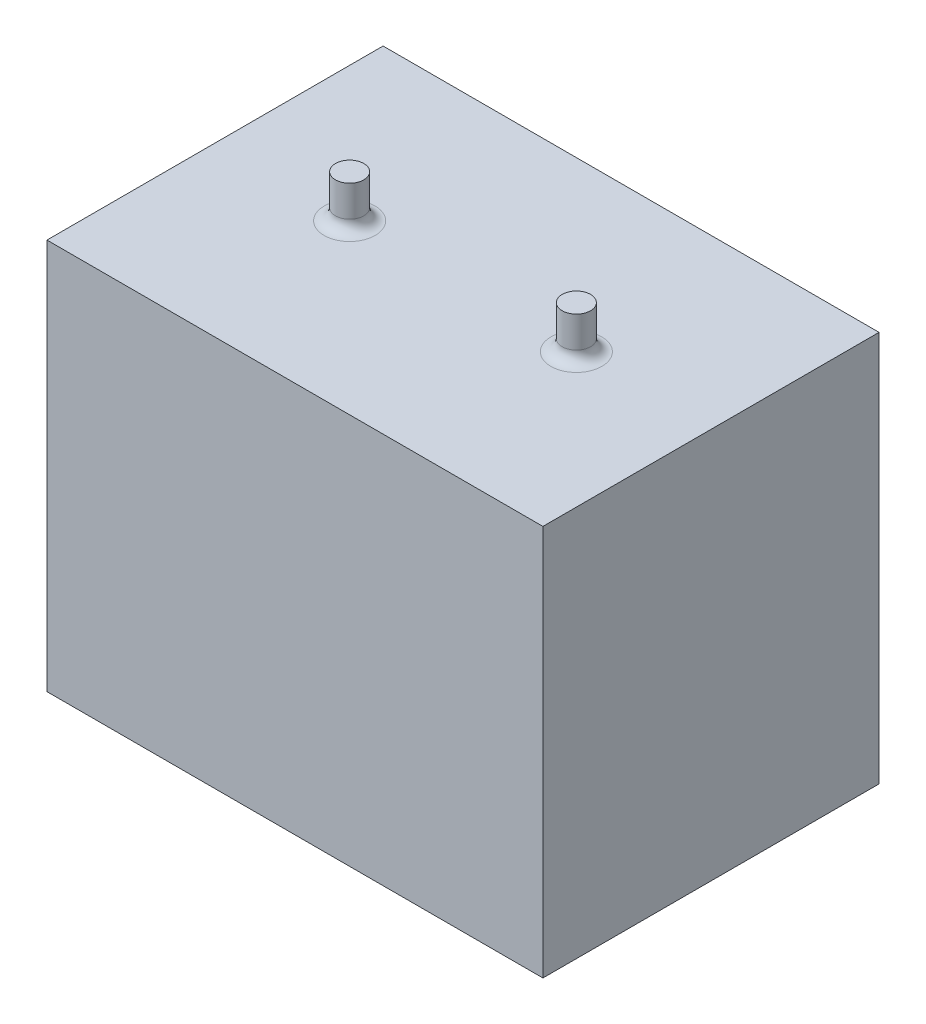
ISO-10303-21;
HEADER;
FILE_DESCRIPTION(('STEP AP214'),'2;1');
FILE_NAME('part.step','',(''),(''),'','','');
FILE_SCHEMA(('AUTOMOTIVE_DESIGN { 1 0 10303 214 1 1 1 1 }'));
ENDSEC;
DATA;
#1=APPLICATION_CONTEXT('core data for automotive mechanical design processes');
#2=APPLICATION_PROTOCOL_DEFINITION('international standard','automotive_design',2000,#1);
#3=PRODUCT_CONTEXT('',#1,'mechanical');
#4=PRODUCT('Part','Part','',(#3));
#5=PRODUCT_RELATED_PRODUCT_CATEGORY('part','',(#4));
#6=PRODUCT_DEFINITION_FORMATION('','',#4);
#7=PRODUCT_DEFINITION_CONTEXT('part definition',#1,'design');
#8=PRODUCT_DEFINITION('design','',#6,#7);
#9=PRODUCT_DEFINITION_SHAPE('','',#8);
#10=(LENGTH_UNIT() NAMED_UNIT(*) SI_UNIT(.MILLI.,.METRE.));
#11=(NAMED_UNIT(*) PLANE_ANGLE_UNIT() SI_UNIT($,.RADIAN.));
#12=(NAMED_UNIT(*) SI_UNIT($,.STERADIAN.) SOLID_ANGLE_UNIT());
#13=UNCERTAINTY_MEASURE_WITH_UNIT(LENGTH_MEASURE(1.E-05),#10,'distance_accuracy_value','');
#14=(GEOMETRIC_REPRESENTATION_CONTEXT(3) GLOBAL_UNCERTAINTY_ASSIGNED_CONTEXT((#13)) GLOBAL_UNIT_ASSIGNED_CONTEXT((#10,
#11,#12)) REPRESENTATION_CONTEXT('',''));
#15=CARTESIAN_POINT('',(0.,0.,0.));
#16=DIRECTION('',(0.,0.,1.));
#17=DIRECTION('',(1.,0.,0.));
#18=AXIS2_PLACEMENT_3D('',#15,#16,#17);
#19=CARTESIAN_POINT('',(0.,0.,150.622));
#20=DIRECTION('',(1.,0.,0.));
#21=DIRECTION('',(0.,1.,0.));
#22=AXIS2_PLACEMENT_3D('',#19,#20,#21);
#23=PLANE('',#22);
#24=DIRECTION('',(0.,-1.,0.));
#25=VECTOR('',#24,1.);
#26=CARTESIAN_POINT('',(0.,0.,0.));
#27=LINE('',#26,#25);
#28=CARTESIAN_POINT('',(0.,175.26,0.));
#29=VERTEX_POINT('',#28);
#30=CARTESIAN_POINT('',(0.,0.,0.));
#31=VERTEX_POINT('',#30);
#32=EDGE_CURVE('E100',#29,#31,#27,.T.);
#33=ORIENTED_EDGE('',*,*,#32,.T.);
#34=DIRECTION('',(0.,0.,-1.));
#35=VECTOR('',#34,1.);
#36=CARTESIAN_POINT('',(0.,0.,150.622));
#37=LINE('',#36,#35);
#38=CARTESIAN_POINT('',(0.,0.,150.622));
#39=VERTEX_POINT('',#38);
#40=EDGE_CURVE('E91',#39,#31,#37,.T.);
#41=ORIENTED_EDGE('',*,*,#40,.F.);
#42=DIRECTION('',(0.,-1.,0.));
#43=VECTOR('',#42,1.);
#44=CARTESIAN_POINT('',(0.,0.,150.622));
#45=LINE('',#44,#43);
#46=CARTESIAN_POINT('',(0.,175.26,150.622));
#47=VERTEX_POINT('',#46);
#48=EDGE_CURVE('E85',#47,#39,#45,.T.);
#49=ORIENTED_EDGE('',*,*,#48,.F.);
#50=DIRECTION('',(0.,0.,-1.));
#51=VECTOR('',#50,1.);
#52=CARTESIAN_POINT('',(0.,175.26,150.622));
#53=LINE('',#52,#51);
#54=EDGE_CURVE('E96',#47,#29,#53,.T.);
#55=ORIENTED_EDGE('',*,*,#54,.T.);
#56=EDGE_LOOP('',(#33,#41,#49,#55));
#57=FACE_BOUND('',#56,.T.);
#58=ADVANCED_FACE('F32',(#57),#23,.F.);
#59=CARTESIAN_POINT('',(0.,0.,150.622));
#60=DIRECTION('',(0.,1.,0.));
#61=DIRECTION('',(0.,0.,1.));
#62=AXIS2_PLACEMENT_3D('',#59,#60,#61);
#63=PLANE('',#62);
#64=DIRECTION('',(1.,0.,0.));
#65=VECTOR('',#64,1.);
#66=CARTESIAN_POINT('',(0.,0.,0.));
#67=LINE('',#66,#65);
#68=CARTESIAN_POINT('',(222.25,0.,0.));
#69=VERTEX_POINT('',#68);
#70=EDGE_CURVE('E90',#31,#69,#67,.T.);
#71=ORIENTED_EDGE('',*,*,#70,.T.);
#72=DIRECTION('',(0.,0.,-1.));
#73=VECTOR('',#72,1.);
#74=CARTESIAN_POINT('',(222.25,0.,150.622));
#75=LINE('',#74,#73);
#76=CARTESIAN_POINT('',(222.25,0.,150.622));
#77=VERTEX_POINT('',#76);
#78=EDGE_CURVE('E88',#77,#69,#75,.T.);
#79=ORIENTED_EDGE('',*,*,#78,.F.);
#80=DIRECTION('',(1.,0.,0.));
#81=VECTOR('',#80,1.);
#82=CARTESIAN_POINT('',(0.,0.,150.622));
#83=LINE('',#82,#81);
#84=EDGE_CURVE('E80',#39,#77,#83,.T.);
#85=ORIENTED_EDGE('',*,*,#84,.F.);
#86=ORIENTED_EDGE('',*,*,#40,.T.);
#87=EDGE_LOOP('',(#71,#79,#85,#86));
#88=FACE_BOUND('',#87,.T.);
#89=ADVANCED_FACE('F89',(#88),#63,.F.);
#90=CARTESIAN_POINT('',(222.25,0.,150.622));
#91=DIRECTION('',(-1.,0.,0.));
#92=DIRECTION('',(0.,-1.,0.));
#93=AXIS2_PLACEMENT_3D('',#90,#91,#92);
#94=PLANE('',#93);
#95=DIRECTION('',(0.,1.,0.));
#96=VECTOR('',#95,1.);
#97=CARTESIAN_POINT('',(222.25,0.,0.));
#98=LINE('',#97,#96);
#99=CARTESIAN_POINT('',(222.25,175.26,0.));
#100=VERTEX_POINT('',#99);
#101=EDGE_CURVE('E66',#69,#100,#98,.T.);
#102=ORIENTED_EDGE('',*,*,#101,.T.);
#103=DIRECTION('',(0.,0.,-1.));
#104=VECTOR('',#103,1.);
#105=CARTESIAN_POINT('',(222.25,175.26,150.622));
#106=LINE('',#105,#104);
#107=CARTESIAN_POINT('',(222.25,175.26,150.622));
#108=VERTEX_POINT('',#107);
#109=EDGE_CURVE('E92',#108,#100,#106,.T.);
#110=ORIENTED_EDGE('',*,*,#109,.F.);
#111=DIRECTION('',(0.,1.,0.));
#112=VECTOR('',#111,1.);
#113=CARTESIAN_POINT('',(222.25,0.,150.622));
#114=LINE('',#113,#112);
#115=EDGE_CURVE('E83',#77,#108,#114,.T.);
#116=ORIENTED_EDGE('',*,*,#115,.F.);
#117=ORIENTED_EDGE('',*,*,#78,.T.);
#118=EDGE_LOOP('',(#102,#110,#116,#117));
#119=FACE_BOUND('',#118,.T.);
#120=ADVANCED_FACE('F94',(#119),#94,.F.);
#121=CARTESIAN_POINT('',(0.,175.26,150.622));
#122=DIRECTION('',(0.,-1.,0.));
#123=DIRECTION('',(0.,0.,-1.));
#124=AXIS2_PLACEMENT_3D('',#121,#122,#123);
#125=PLANE('',#124);
#126=CARTESIAN_POINT('',(161.925,175.26,75.311));
#127=DIRECTION('',(0.,-1.,0.));
#128=DIRECTION('',(0.,0.,-1.));
#129=AXIS2_PLACEMENT_3D('',#126,#127,#128);
#130=CIRCLE('',#129,11.43);
#131=CARTESIAN_POINT('',(161.925,175.26,63.881));
#132=VERTEX_POINT('',#131);
#133=EDGE_CURVE('E11',#132,#132,#130,.T.);
#134=ORIENTED_EDGE('',*,*,#133,.T.);
#135=EDGE_LOOP('',(#134));
#136=FACE_BOUND('',#135,.T.);
#137=CARTESIAN_POINT('',(60.325,175.26,75.311));
#138=DIRECTION('',(0.,-1.,0.));
#139=DIRECTION('',(0.,0.,-1.));
#140=AXIS2_PLACEMENT_3D('',#137,#138,#139);
#141=CIRCLE('',#140,11.43);
#142=CARTESIAN_POINT('',(60.325,175.26,63.881));
#143=VERTEX_POINT('',#142);
#144=EDGE_CURVE('E113',#143,#143,#141,.T.);
#145=ORIENTED_EDGE('',*,*,#144,.T.);
#146=EDGE_LOOP('',(#145));
#147=FACE_BOUND('',#146,.T.);
#148=DIRECTION('',(-1.,0.,0.));
#149=VECTOR('',#148,1.);
#150=CARTESIAN_POINT('',(0.,175.26,0.));
#151=LINE('',#150,#149);
#152=EDGE_CURVE('E72',#100,#29,#151,.T.);
#153=ORIENTED_EDGE('',*,*,#152,.T.);
#154=ORIENTED_EDGE('',*,*,#54,.F.);
#155=DIRECTION('',(-1.,0.,0.));
#156=VECTOR('',#155,1.);
#157=CARTESIAN_POINT('',(0.,175.26,150.622));
#158=LINE('',#157,#156);
#159=EDGE_CURVE('E49',#108,#47,#158,.T.);
#160=ORIENTED_EDGE('',*,*,#159,.F.);
#161=ORIENTED_EDGE('',*,*,#109,.T.);
#162=EDGE_LOOP('',(#153,#154,#160,#161));
#163=FACE_BOUND('',#162,.T.);
#164=ADVANCED_FACE('F140',(#136,#147,#163),#125,.F.);
#165=CARTESIAN_POINT('',(0.,0.,150.622));
#166=DIRECTION('',(0.,0.,-1.));
#167=DIRECTION('',(-1.,0.,0.));
#168=AXIS2_PLACEMENT_3D('',#165,#166,#167);
#169=PLANE('',#168);
#170=ORIENTED_EDGE('',*,*,#48,.T.);
#171=ORIENTED_EDGE('',*,*,#84,.T.);
#172=ORIENTED_EDGE('',*,*,#115,.T.);
#173=ORIENTED_EDGE('',*,*,#159,.T.);
#174=EDGE_LOOP('',(#170,#171,#172,#173));
#175=FACE_BOUND('',#174,.T.);
#176=ADVANCED_FACE('F81',(#175),#169,.F.);
#177=CARTESIAN_POINT('',(0.,0.,0.));
#178=DIRECTION('',(0.,0.,-1.));
#179=DIRECTION('',(-1.,0.,0.));
#180=AXIS2_PLACEMENT_3D('',#177,#178,#179);
#181=PLANE('',#180);
#182=ORIENTED_EDGE('',*,*,#32,.F.);
#183=ORIENTED_EDGE('',*,*,#152,.F.);
#184=ORIENTED_EDGE('',*,*,#101,.F.);
#185=ORIENTED_EDGE('',*,*,#70,.F.);
#186=EDGE_LOOP('',(#182,#183,#184,#185));
#187=FACE_BOUND('',#186,.T.);
#188=ADVANCED_FACE('F144',(#187),#181,.T.);
#189=CARTESIAN_POINT('',(60.325,194.31,75.311));
#190=DIRECTION('',(0.,-1.,0.));
#191=DIRECTION('',(0.,0.,-1.));
#192=AXIS2_PLACEMENT_3D('',#189,#190,#191);
#193=CYLINDRICAL_SURFACE('',#192,6.35);
#194=CARTESIAN_POINT('',(60.325,180.34,75.311));
#195=DIRECTION('',(0.,-1.,0.));
#196=DIRECTION('',(0.,0.,-1.));
#197=AXIS2_PLACEMENT_3D('',#194,#195,#196);
#198=CIRCLE('',#197,6.35);
#199=CARTESIAN_POINT('',(60.325,180.34,68.961));
#200=VERTEX_POINT('',#199);
#201=EDGE_CURVE('E110',#200,#200,#198,.F.);
#202=CARTESIAN_POINT('',(60.325,194.31,75.311));
#203=DIRECTION('',(0.,1.,0.));
#204=DIRECTION('',(0.,0.,1.));
#205=AXIS2_PLACEMENT_3D('',#202,#203,#204);
#206=CIRCLE('',#205,6.35);
#207=CARTESIAN_POINT('',(60.325,194.31,68.961));
#208=VERTEX_POINT('',#207);
#209=EDGE_CURVE('E103',#208,#208,#206,.T.);
#210=CARTESIAN_POINT('',(60.325,180.34,68.961));
#211=CARTESIAN_POINT('',(60.325,180.485520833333,68.961));
#212=CARTESIAN_POINT('',(60.325,180.631041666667,68.961));
#213=CARTESIAN_POINT('',(60.325,180.922083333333,68.961));
#214=CARTESIAN_POINT('',(60.325,181.067604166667,68.961));
#215=CARTESIAN_POINT('',(60.325,181.358645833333,68.961));
#216=CARTESIAN_POINT('',(60.325,181.504166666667,68.961));
#217=CARTESIAN_POINT('',(60.325,181.795208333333,68.961));
#218=CARTESIAN_POINT('',(60.325,181.940729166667,68.961));
#219=CARTESIAN_POINT('',(60.325,182.231770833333,68.961));
#220=CARTESIAN_POINT('',(60.325,182.377291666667,68.961));
#221=CARTESIAN_POINT('',(60.325,182.668333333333,68.961));
#222=CARTESIAN_POINT('',(60.325,182.813854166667,68.961));
#223=CARTESIAN_POINT('',(60.325,183.104895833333,68.961));
#224=CARTESIAN_POINT('',(60.325,183.250416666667,68.961));
#225=CARTESIAN_POINT('',(60.325,183.541458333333,68.961));
#226=CARTESIAN_POINT('',(60.325,183.686979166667,68.961));
#227=CARTESIAN_POINT('',(60.325,183.978020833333,68.961));
#228=CARTESIAN_POINT('',(60.325,184.123541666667,68.961));
#229=CARTESIAN_POINT('',(60.325,184.414583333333,68.961));
#230=CARTESIAN_POINT('',(60.325,184.560104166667,68.961));
#231=CARTESIAN_POINT('',(60.325,184.851145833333,68.961));
#232=CARTESIAN_POINT('',(60.325,184.996666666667,68.961));
#233=CARTESIAN_POINT('',(60.325,185.287708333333,68.961));
#234=CARTESIAN_POINT('',(60.325,185.433229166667,68.961));
#235=CARTESIAN_POINT('',(60.325,185.724270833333,68.961));
#236=CARTESIAN_POINT('',(60.325,185.869791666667,68.961));
#237=CARTESIAN_POINT('',(60.325,186.160833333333,68.961));
#238=CARTESIAN_POINT('',(60.325,186.306354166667,68.961));
#239=CARTESIAN_POINT('',(60.325,186.597395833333,68.961));
#240=CARTESIAN_POINT('',(60.325,186.742916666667,68.961));
#241=CARTESIAN_POINT('',(60.325,187.033958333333,68.961));
#242=CARTESIAN_POINT('',(60.325,187.179479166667,68.961));
#243=CARTESIAN_POINT('',(60.325,187.470520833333,68.961));
#244=CARTESIAN_POINT('',(60.325,187.616041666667,68.961));
#245=CARTESIAN_POINT('',(60.325,187.907083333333,68.961));
#246=CARTESIAN_POINT('',(60.325,188.052604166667,68.961));
#247=CARTESIAN_POINT('',(60.325,188.343645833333,68.961));
#248=CARTESIAN_POINT('',(60.325,188.489166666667,68.961));
#249=CARTESIAN_POINT('',(60.325,188.780208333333,68.961));
#250=CARTESIAN_POINT('',(60.325,188.925729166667,68.961));
#251=CARTESIAN_POINT('',(60.325,189.216770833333,68.961));
#252=CARTESIAN_POINT('',(60.325,189.362291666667,68.961));
#253=CARTESIAN_POINT('',(60.325,189.653333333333,68.961));
#254=CARTESIAN_POINT('',(60.325,189.798854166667,68.961));
#255=CARTESIAN_POINT('',(60.325,190.089895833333,68.961));
#256=CARTESIAN_POINT('',(60.325,190.235416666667,68.961));
#257=CARTESIAN_POINT('',(60.325,190.526458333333,68.961));
#258=CARTESIAN_POINT('',(60.325,190.671979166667,68.961));
#259=CARTESIAN_POINT('',(60.325,190.963020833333,68.961));
#260=CARTESIAN_POINT('',(60.325,191.108541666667,68.961));
#261=CARTESIAN_POINT('',(60.325,191.399583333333,68.961));
#262=CARTESIAN_POINT('',(60.325,191.545104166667,68.961));
#263=CARTESIAN_POINT('',(60.325,191.836145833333,68.961));
#264=CARTESIAN_POINT('',(60.325,191.981666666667,68.961));
#265=CARTESIAN_POINT('',(60.325,192.272708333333,68.961));
#266=CARTESIAN_POINT('',(60.325,192.418229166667,68.961));
#267=CARTESIAN_POINT('',(60.325,192.709270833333,68.961));
#268=CARTESIAN_POINT('',(60.325,192.854791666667,68.961));
#269=CARTESIAN_POINT('',(60.325,193.145833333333,68.961));
#270=CARTESIAN_POINT('',(60.325,193.291354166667,68.961));
#271=CARTESIAN_POINT('',(60.325,193.582395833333,68.961));
#272=CARTESIAN_POINT('',(60.325,193.727916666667,68.961));
#273=CARTESIAN_POINT('',(60.325,194.018958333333,68.961));
#274=CARTESIAN_POINT('',(60.325,194.164479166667,68.961));
#275=CARTESIAN_POINT('',(60.325,194.31,68.961));
#276=B_SPLINE_CURVE_WITH_KNOTS('',3,(#210,#211,#212,#213,#214,#215,#216,#217,#218,#219,#220,
#221,#222,#223,#224,#225,#226,#227,#228,#229,#230,#231,#232,#233,#234,#235,#236,#237,#238,#239,
#240,#241,#242,#243,#244,#245,#246,#247,#248,#249,#250,#251,#252,#253,#254,#255,#256,#257,#258,
#259,#260,#261,#262,#263,#264,#265,#266,#267,#268,#269,#270,#271,#272,#273,#274,#275),
.UNSPECIFIED.,.F.,.F.,(4,2,2,2,2,2,2,2,2,2,2,2,2,2,2,2,2,2,2,2,2,2,2,2,2,2,2,2,2,2,2,2,4),(0.,
0.436562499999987,0.873124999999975,1.30968749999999,1.74624999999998,2.18281249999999,
2.61937499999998,3.05593749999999,3.49249999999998,3.9290625,4.36562499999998,4.80218749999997,
5.23874999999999,5.67531249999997,6.11187499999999,6.54843749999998,6.98499999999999,
7.42156249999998,7.85812499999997,8.29468749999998,8.73124999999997,9.16781249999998,
9.60437499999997,10.0409375,10.4775,10.9140625,11.350625,11.7871875,12.22375,12.6603125,
13.096875,13.5334375,13.97),.UNSPECIFIED.);
#277=EDGE_CURVE('BSEAM147',#200,#208,#276,.T.);
#278=ORIENTED_EDGE('',*,*,#201,.T.);
#279=ORIENTED_EDGE('',*,*,#209,.F.);
#280=ORIENTED_EDGE('',*,*,#277,.T.);
#281=ORIENTED_EDGE('',*,*,#277,.F.);
#282=EDGE_LOOP('',(#278,#280,#279,#281));
#283=FACE_BOUND('',#282,.T.);
#284=ADVANCED_FACE('F147',(#283),#193,.T.);
#285=CARTESIAN_POINT('',(60.325,194.31,75.311));
#286=DIRECTION('',(0.,1.,0.));
#287=DIRECTION('',(0.,0.,1.));
#288=AXIS2_PLACEMENT_3D('',#285,#286,#287);
#289=PLANE('',#288);
#290=ORIENTED_EDGE('',*,*,#209,.T.);
#291=EDGE_LOOP('',(#290));
#292=FACE_BOUND('',#291,.T.);
#293=ADVANCED_FACE('F153',(#292),#289,.T.);
#294=CARTESIAN_POINT('',(161.925,194.31,75.311));
#295=DIRECTION('',(0.,-1.,0.));
#296=DIRECTION('',(0.,0.,-1.));
#297=AXIS2_PLACEMENT_3D('',#294,#295,#296);
#298=CYLINDRICAL_SURFACE('',#297,6.34999999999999);
#299=CARTESIAN_POINT('',(161.925,180.34,75.311));
#300=DIRECTION('',(0.,-1.,0.));
#301=DIRECTION('',(0.,0.,-1.));
#302=AXIS2_PLACEMENT_3D('',#299,#300,#301);
#303=CIRCLE('',#302,6.34999999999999);
#304=CARTESIAN_POINT('',(161.925,180.34,68.961));
#305=VERTEX_POINT('',#304);
#306=EDGE_CURVE('E41',#305,#305,#303,.F.);
#307=CARTESIAN_POINT('',(161.925,194.31,75.311));
#308=DIRECTION('',(0.,1.,0.));
#309=DIRECTION('',(0.,0.,1.));
#310=AXIS2_PLACEMENT_3D('',#307,#308,#309);
#311=CIRCLE('',#310,6.34999999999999);
#312=CARTESIAN_POINT('',(161.925,194.31,68.961));
#313=VERTEX_POINT('',#312);
#314=EDGE_CURVE('E166',#313,#313,#311,.T.);
#315=CARTESIAN_POINT('',(161.925,180.34,68.961));
#316=CARTESIAN_POINT('',(161.925,180.485520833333,68.961));
#317=CARTESIAN_POINT('',(161.925,180.631041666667,68.961));
#318=CARTESIAN_POINT('',(161.925,180.922083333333,68.961));
#319=CARTESIAN_POINT('',(161.925,181.067604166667,68.961));
#320=CARTESIAN_POINT('',(161.925,181.358645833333,68.961));
#321=CARTESIAN_POINT('',(161.925,181.504166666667,68.961));
#322=CARTESIAN_POINT('',(161.925,181.795208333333,68.961));
#323=CARTESIAN_POINT('',(161.925,181.940729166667,68.961));
#324=CARTESIAN_POINT('',(161.925,182.231770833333,68.961));
#325=CARTESIAN_POINT('',(161.925,182.377291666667,68.961));
#326=CARTESIAN_POINT('',(161.925,182.668333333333,68.961));
#327=CARTESIAN_POINT('',(161.925,182.813854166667,68.961));
#328=CARTESIAN_POINT('',(161.925,183.104895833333,68.961));
#329=CARTESIAN_POINT('',(161.925,183.250416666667,68.961));
#330=CARTESIAN_POINT('',(161.925,183.541458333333,68.961));
#331=CARTESIAN_POINT('',(161.925,183.686979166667,68.961));
#332=CARTESIAN_POINT('',(161.925,183.978020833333,68.961));
#333=CARTESIAN_POINT('',(161.925,184.123541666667,68.961));
#334=CARTESIAN_POINT('',(161.925,184.414583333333,68.961));
#335=CARTESIAN_POINT('',(161.925,184.560104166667,68.961));
#336=CARTESIAN_POINT('',(161.925,184.851145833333,68.961));
#337=CARTESIAN_POINT('',(161.925,184.996666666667,68.961));
#338=CARTESIAN_POINT('',(161.925,185.287708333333,68.961));
#339=CARTESIAN_POINT('',(161.925,185.433229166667,68.961));
#340=CARTESIAN_POINT('',(161.925,185.724270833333,68.961));
#341=CARTESIAN_POINT('',(161.925,185.869791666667,68.961));
#342=CARTESIAN_POINT('',(161.925,186.160833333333,68.961));
#343=CARTESIAN_POINT('',(161.925,186.306354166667,68.961));
#344=CARTESIAN_POINT('',(161.925,186.597395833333,68.961));
#345=CARTESIAN_POINT('',(161.925,186.742916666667,68.961));
#346=CARTESIAN_POINT('',(161.925,187.033958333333,68.961));
#347=CARTESIAN_POINT('',(161.925,187.179479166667,68.961));
#348=CARTESIAN_POINT('',(161.925,187.470520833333,68.961));
#349=CARTESIAN_POINT('',(161.925,187.616041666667,68.961));
#350=CARTESIAN_POINT('',(161.925,187.907083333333,68.961));
#351=CARTESIAN_POINT('',(161.925,188.052604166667,68.961));
#352=CARTESIAN_POINT('',(161.925,188.343645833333,68.961));
#353=CARTESIAN_POINT('',(161.925,188.489166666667,68.961));
#354=CARTESIAN_POINT('',(161.925,188.780208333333,68.961));
#355=CARTESIAN_POINT('',(161.925,188.925729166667,68.961));
#356=CARTESIAN_POINT('',(161.925,189.216770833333,68.961));
#357=CARTESIAN_POINT('',(161.925,189.362291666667,68.961));
#358=CARTESIAN_POINT('',(161.925,189.653333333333,68.961));
#359=CARTESIAN_POINT('',(161.925,189.798854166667,68.961));
#360=CARTESIAN_POINT('',(161.925,190.089895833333,68.961));
#361=CARTESIAN_POINT('',(161.925,190.235416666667,68.961));
#362=CARTESIAN_POINT('',(161.925,190.526458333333,68.961));
#363=CARTESIAN_POINT('',(161.925,190.671979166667,68.961));
#364=CARTESIAN_POINT('',(161.925,190.963020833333,68.961));
#365=CARTESIAN_POINT('',(161.925,191.108541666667,68.961));
#366=CARTESIAN_POINT('',(161.925,191.399583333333,68.961));
#367=CARTESIAN_POINT('',(161.925,191.545104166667,68.961));
#368=CARTESIAN_POINT('',(161.925,191.836145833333,68.961));
#369=CARTESIAN_POINT('',(161.925,191.981666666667,68.961));
#370=CARTESIAN_POINT('',(161.925,192.272708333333,68.961));
#371=CARTESIAN_POINT('',(161.925,192.418229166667,68.961));
#372=CARTESIAN_POINT('',(161.925,192.709270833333,68.961));
#373=CARTESIAN_POINT('',(161.925,192.854791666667,68.961));
#374=CARTESIAN_POINT('',(161.925,193.145833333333,68.961));
#375=CARTESIAN_POINT('',(161.925,193.291354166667,68.961));
#376=CARTESIAN_POINT('',(161.925,193.582395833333,68.961));
#377=CARTESIAN_POINT('',(161.925,193.727916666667,68.961));
#378=CARTESIAN_POINT('',(161.925,194.018958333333,68.961));
#379=CARTESIAN_POINT('',(161.925,194.164479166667,68.961));
#380=CARTESIAN_POINT('',(161.925,194.31,68.961));
#381=B_SPLINE_CURVE_WITH_KNOTS('',3,(#315,#316,#317,#318,#319,#320,#321,#322,#323,#324,#325,
#326,#327,#328,#329,#330,#331,#332,#333,#334,#335,#336,#337,#338,#339,#340,#341,#342,#343,#344,
#345,#346,#347,#348,#349,#350,#351,#352,#353,#354,#355,#356,#357,#358,#359,#360,#361,#362,#363,
#364,#365,#366,#367,#368,#369,#370,#371,#372,#373,#374,#375,#376,#377,#378,#379,#380),
.UNSPECIFIED.,.F.,.F.,(4,2,2,2,2,2,2,2,2,2,2,2,2,2,2,2,2,2,2,2,2,2,2,2,2,2,2,2,2,2,2,2,4),(0.,
0.436562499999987,0.873124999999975,1.30968749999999,1.74624999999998,2.18281249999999,
2.61937499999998,3.05593749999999,3.49249999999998,3.9290625,4.36562499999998,4.80218749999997,
5.23874999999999,5.67531249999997,6.11187499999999,6.54843749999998,6.98499999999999,
7.42156249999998,7.85812499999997,8.29468749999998,8.73124999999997,9.16781249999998,
9.60437499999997,10.0409375,10.4775,10.9140625,11.350625,11.7871875,12.22375,12.6603125,
13.096875,13.5334375,13.97),.UNSPECIFIED.);
#382=EDGE_CURVE('BSEAM118',#305,#313,#381,.T.);
#383=ORIENTED_EDGE('',*,*,#306,.T.);
#384=ORIENTED_EDGE('',*,*,#314,.F.);
#385=ORIENTED_EDGE('',*,*,#382,.T.);
#386=ORIENTED_EDGE('',*,*,#382,.F.);
#387=EDGE_LOOP('',(#383,#385,#384,#386));
#388=FACE_BOUND('',#387,.T.);
#389=ADVANCED_FACE('F118',(#388),#298,.T.);
#390=CARTESIAN_POINT('',(161.925,194.31,75.311));
#391=DIRECTION('',(0.,1.,0.));
#392=DIRECTION('',(0.,0.,1.));
#393=AXIS2_PLACEMENT_3D('',#390,#391,#392);
#394=PLANE('',#393);
#395=ORIENTED_EDGE('',*,*,#314,.T.);
#396=EDGE_LOOP('',(#395));
#397=FACE_BOUND('',#396,.T.);
#398=ADVANCED_FACE('F127',(#397),#394,.T.);
#399=CARTESIAN_POINT('',(60.325,180.34,75.311));
#400=DIRECTION('',(0.,-1.,0.));
#401=DIRECTION('',(0.,0.,-1.));
#402=AXIS2_PLACEMENT_3D('',#399,#400,#401);
#403=TOROIDAL_SURFACE('',#402,11.43,5.08);
#404=ORIENTED_EDGE('',*,*,#144,.F.);
#405=EDGE_LOOP('',(#404));
#406=FACE_BOUND('',#405,.T.);
#407=ORIENTED_EDGE('',*,*,#201,.F.);
#408=EDGE_LOOP('',(#407));
#409=FACE_BOUND('',#408,.T.);
#410=ADVANCED_FACE('F122',(#406,#409),#403,.F.);
#411=CARTESIAN_POINT('',(161.925,180.34,75.311));
#412=DIRECTION('',(0.,-1.,0.));
#413=DIRECTION('',(0.,0.,-1.));
#414=AXIS2_PLACEMENT_3D('',#411,#412,#413);
#415=TOROIDAL_SURFACE('',#414,11.43,5.08);
#416=ORIENTED_EDGE('',*,*,#133,.F.);
#417=EDGE_LOOP('',(#416));
#418=FACE_BOUND('',#417,.T.);
#419=ORIENTED_EDGE('',*,*,#306,.F.);
#420=EDGE_LOOP('',(#419));
#421=FACE_BOUND('',#420,.T.);
#422=ADVANCED_FACE('F34',(#418,#421),#415,.F.);
#423=CLOSED_SHELL('',(#58,#89,#120,#164,#176,#188,#284,#293,#389,#398,#410,#422));
#424=MANIFOLD_SOLID_BREP('B2',#423);
#425=ADVANCED_BREP_SHAPE_REPRESENTATION('',(#18,#424),#14);
#426=SHAPE_DEFINITION_REPRESENTATION(#9,#425);
ENDSEC;
END-ISO-10303-21;
